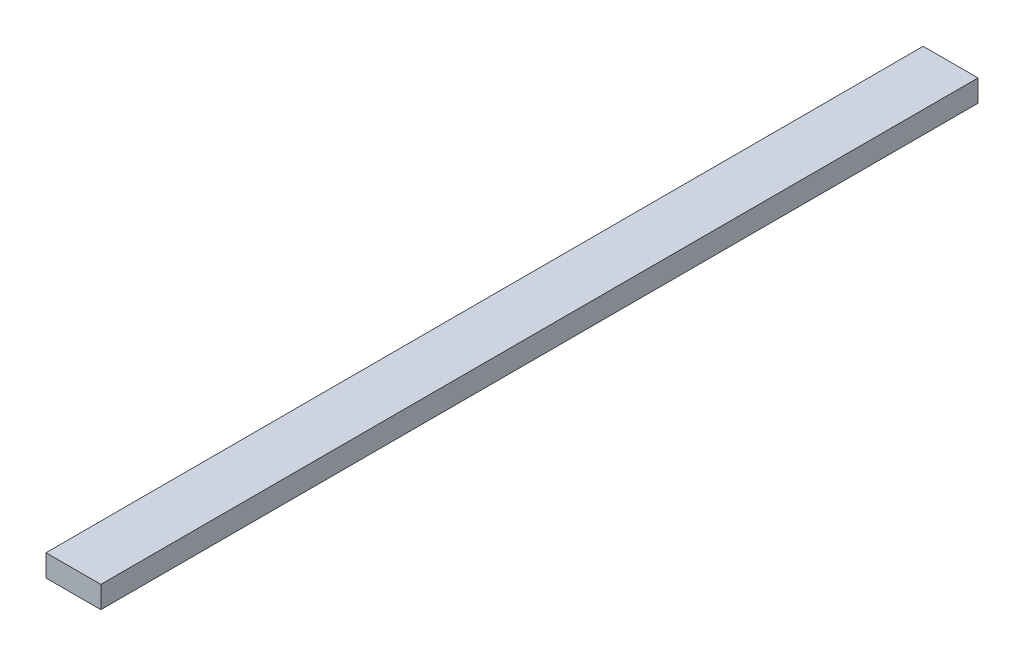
ISO-10303-21;
HEADER;
FILE_DESCRIPTION(('STEP AP214'),'2;1');
FILE_NAME('part.step','',(''),(''),'','','');
FILE_SCHEMA(('AUTOMOTIVE_DESIGN { 1 0 10303 214 1 1 1 1 }'));
ENDSEC;
DATA;
#1=APPLICATION_CONTEXT('core data for automotive mechanical design processes');
#2=APPLICATION_PROTOCOL_DEFINITION('international standard','automotive_design',2000,#1);
#3=PRODUCT_CONTEXT('',#1,'mechanical');
#4=PRODUCT('Part','Part','',(#3));
#5=PRODUCT_RELATED_PRODUCT_CATEGORY('part','',(#4));
#6=PRODUCT_DEFINITION_FORMATION('','',#4);
#7=PRODUCT_DEFINITION_CONTEXT('part definition',#1,'design');
#8=PRODUCT_DEFINITION('design','',#6,#7);
#9=PRODUCT_DEFINITION_SHAPE('','',#8);
#10=(LENGTH_UNIT() NAMED_UNIT(*) SI_UNIT(.MILLI.,.METRE.));
#11=(NAMED_UNIT(*) PLANE_ANGLE_UNIT() SI_UNIT($,.RADIAN.));
#12=(NAMED_UNIT(*) SI_UNIT($,.STERADIAN.) SOLID_ANGLE_UNIT());
#13=UNCERTAINTY_MEASURE_WITH_UNIT(LENGTH_MEASURE(1.E-05),#10,'distance_accuracy_value','');
#14=(GEOMETRIC_REPRESENTATION_CONTEXT(3) GLOBAL_UNCERTAINTY_ASSIGNED_CONTEXT((#13)) GLOBAL_UNIT_ASSIGNED_CONTEXT((#10,
#11,#12)) REPRESENTATION_CONTEXT('',''));
#15=CARTESIAN_POINT('',(0.,0.,0.));
#16=DIRECTION('',(0.,0.,1.));
#17=DIRECTION('',(1.,0.,0.));
#18=AXIS2_PLACEMENT_3D('',#15,#16,#17);
#19=CARTESIAN_POINT('',(0.,0.,80.));
#20=DIRECTION('',(1.,0.,0.));
#21=DIRECTION('',(0.,0.,-1.));
#22=AXIS2_PLACEMENT_3D('',#19,#20,#21);
#23=PLANE('',#22);
#24=DIRECTION('',(0.,-1.,0.));
#25=VECTOR('',#24,1.);
#26=CARTESIAN_POINT('',(0.,0.,0.));
#27=LINE('',#26,#25);
#28=CARTESIAN_POINT('',(0.,2.,0.));
#29=VERTEX_POINT('',#28);
#30=CARTESIAN_POINT('',(0.,0.,0.));
#31=VERTEX_POINT('',#30);
#32=EDGE_CURVE('E94',#29,#31,#27,.T.);
#33=ORIENTED_EDGE('',*,*,#32,.T.);
#34=DIRECTION('',(0.,0.,-1.));
#35=VECTOR('',#34,1.);
#36=CARTESIAN_POINT('',(0.,0.,80.));
#37=LINE('',#36,#35);
#38=CARTESIAN_POINT('',(0.,0.,80.));
#39=VERTEX_POINT('',#38);
#40=EDGE_CURVE('E11',#39,#31,#37,.T.);
#41=ORIENTED_EDGE('',*,*,#40,.F.);
#42=DIRECTION('',(0.,-1.,0.));
#43=VECTOR('',#42,1.);
#44=CARTESIAN_POINT('',(0.,0.,80.));
#45=LINE('',#44,#43);
#46=CARTESIAN_POINT('',(0.,2.,80.));
#47=VERTEX_POINT('',#46);
#48=EDGE_CURVE('E82',#47,#39,#45,.T.);
#49=ORIENTED_EDGE('',*,*,#48,.F.);
#50=DIRECTION('',(0.,0.,-1.));
#51=VECTOR('',#50,1.);
#52=CARTESIAN_POINT('',(0.,2.,80.));
#53=LINE('',#52,#51);
#54=EDGE_CURVE('E90',#47,#29,#53,.T.);
#55=ORIENTED_EDGE('',*,*,#54,.T.);
#56=EDGE_LOOP('',(#33,#41,#49,#55));
#57=FACE_BOUND('',#56,.T.);
#58=ADVANCED_FACE('F31',(#57),#23,.F.);
#59=CARTESIAN_POINT('',(0.,0.,80.));
#60=DIRECTION('',(0.,1.,0.));
#61=DIRECTION('',(0.,0.,1.));
#62=AXIS2_PLACEMENT_3D('',#59,#60,#61);
#63=PLANE('',#62);
#64=DIRECTION('',(1.,0.,0.));
#65=VECTOR('',#64,1.);
#66=CARTESIAN_POINT('',(0.,0.,0.));
#67=LINE('',#66,#65);
#68=CARTESIAN_POINT('',(5.,0.,0.));
#69=VERTEX_POINT('',#68);
#70=EDGE_CURVE('E86',#31,#69,#67,.T.);
#71=ORIENTED_EDGE('',*,*,#70,.T.);
#72=DIRECTION('',(0.,0.,-1.));
#73=VECTOR('',#72,1.);
#74=CARTESIAN_POINT('',(5.,0.,80.));
#75=LINE('',#74,#73);
#76=CARTESIAN_POINT('',(5.,0.,80.));
#77=VERTEX_POINT('',#76);
#78=EDGE_CURVE('E39',#77,#69,#75,.T.);
#79=ORIENTED_EDGE('',*,*,#78,.F.);
#80=DIRECTION('',(1.,0.,0.));
#81=VECTOR('',#80,1.);
#82=CARTESIAN_POINT('',(0.,0.,80.));
#83=LINE('',#82,#81);
#84=EDGE_CURVE('E77',#39,#77,#83,.T.);
#85=ORIENTED_EDGE('',*,*,#84,.F.);
#86=ORIENTED_EDGE('',*,*,#40,.T.);
#87=EDGE_LOOP('',(#71,#79,#85,#86));
#88=FACE_BOUND('',#87,.T.);
#89=ADVANCED_FACE('F85',(#88),#63,.F.);
#90=CARTESIAN_POINT('',(5.,0.,80.));
#91=DIRECTION('',(-1.,0.,0.));
#92=DIRECTION('',(0.,-1.,0.));
#93=AXIS2_PLACEMENT_3D('',#90,#91,#92);
#94=PLANE('',#93);
#95=DIRECTION('',(0.,1.,0.));
#96=VECTOR('',#95,1.);
#97=CARTESIAN_POINT('',(5.,0.,0.));
#98=LINE('',#97,#96);
#99=CARTESIAN_POINT('',(5.,2.,0.));
#100=VERTEX_POINT('',#99);
#101=EDGE_CURVE('E64',#69,#100,#98,.T.);
#102=ORIENTED_EDGE('',*,*,#101,.T.);
#103=DIRECTION('',(0.,0.,-1.));
#104=VECTOR('',#103,1.);
#105=CARTESIAN_POINT('',(5.,2.,80.));
#106=LINE('',#105,#104);
#107=CARTESIAN_POINT('',(5.,2.,80.));
#108=VERTEX_POINT('',#107);
#109=EDGE_CURVE('E87',#108,#100,#106,.T.);
#110=ORIENTED_EDGE('',*,*,#109,.F.);
#111=DIRECTION('',(0.,1.,0.));
#112=VECTOR('',#111,1.);
#113=CARTESIAN_POINT('',(5.,0.,80.));
#114=LINE('',#113,#112);
#115=EDGE_CURVE('E80',#77,#108,#114,.T.);
#116=ORIENTED_EDGE('',*,*,#115,.F.);
#117=ORIENTED_EDGE('',*,*,#78,.T.);
#118=EDGE_LOOP('',(#102,#110,#116,#117));
#119=FACE_BOUND('',#118,.T.);
#120=ADVANCED_FACE('F88',(#119),#94,.F.);
#121=CARTESIAN_POINT('',(0.,2.,80.));
#122=DIRECTION('',(0.,-1.,0.));
#123=DIRECTION('',(0.,0.,-1.));
#124=AXIS2_PLACEMENT_3D('',#121,#122,#123);
#125=PLANE('',#124);
#126=DIRECTION('',(-1.,0.,0.));
#127=VECTOR('',#126,1.);
#128=CARTESIAN_POINT('',(0.,2.,0.));
#129=LINE('',#128,#127);
#130=EDGE_CURVE('E70',#100,#29,#129,.T.);
#131=ORIENTED_EDGE('',*,*,#130,.T.);
#132=ORIENTED_EDGE('',*,*,#54,.F.);
#133=DIRECTION('',(-1.,0.,0.));
#134=VECTOR('',#133,1.);
#135=CARTESIAN_POINT('',(0.,2.,80.));
#136=LINE('',#135,#134);
#137=EDGE_CURVE('E47',#108,#47,#136,.T.);
#138=ORIENTED_EDGE('',*,*,#137,.F.);
#139=ORIENTED_EDGE('',*,*,#109,.T.);
#140=EDGE_LOOP('',(#131,#132,#138,#139));
#141=FACE_BOUND('',#140,.T.);
#142=ADVANCED_FACE('F101',(#141),#125,.F.);
#143=CARTESIAN_POINT('',(0.,2.,80.));
#144=DIRECTION('',(0.,0.,-1.));
#145=DIRECTION('',(-1.,0.,0.));
#146=AXIS2_PLACEMENT_3D('',#143,#144,#145);
#147=PLANE('',#146);
#148=ORIENTED_EDGE('',*,*,#48,.T.);
#149=ORIENTED_EDGE('',*,*,#84,.T.);
#150=ORIENTED_EDGE('',*,*,#115,.T.);
#151=ORIENTED_EDGE('',*,*,#137,.T.);
#152=EDGE_LOOP('',(#148,#149,#150,#151));
#153=FACE_BOUND('',#152,.T.);
#154=ADVANCED_FACE('F78',(#153),#147,.F.);
#155=CARTESIAN_POINT('',(0.,2.,0.));
#156=DIRECTION('',(0.,0.,-1.));
#157=DIRECTION('',(-1.,0.,0.));
#158=AXIS2_PLACEMENT_3D('',#155,#156,#157);
#159=PLANE('',#158);
#160=ORIENTED_EDGE('',*,*,#32,.F.);
#161=ORIENTED_EDGE('',*,*,#130,.F.);
#162=ORIENTED_EDGE('',*,*,#101,.F.);
#163=ORIENTED_EDGE('',*,*,#70,.F.);
#164=EDGE_LOOP('',(#160,#161,#162,#163));
#165=FACE_BOUND('',#164,.T.);
#166=ADVANCED_FACE('F104',(#165),#159,.T.);
#167=CLOSED_SHELL('',(#58,#89,#120,#142,#154,#166));
#168=MANIFOLD_SOLID_BREP('B2',#167);
#169=ADVANCED_BREP_SHAPE_REPRESENTATION('',(#18,#168),#14);
#170=SHAPE_DEFINITION_REPRESENTATION(#9,#169);
ENDSEC;
END-ISO-10303-21;
